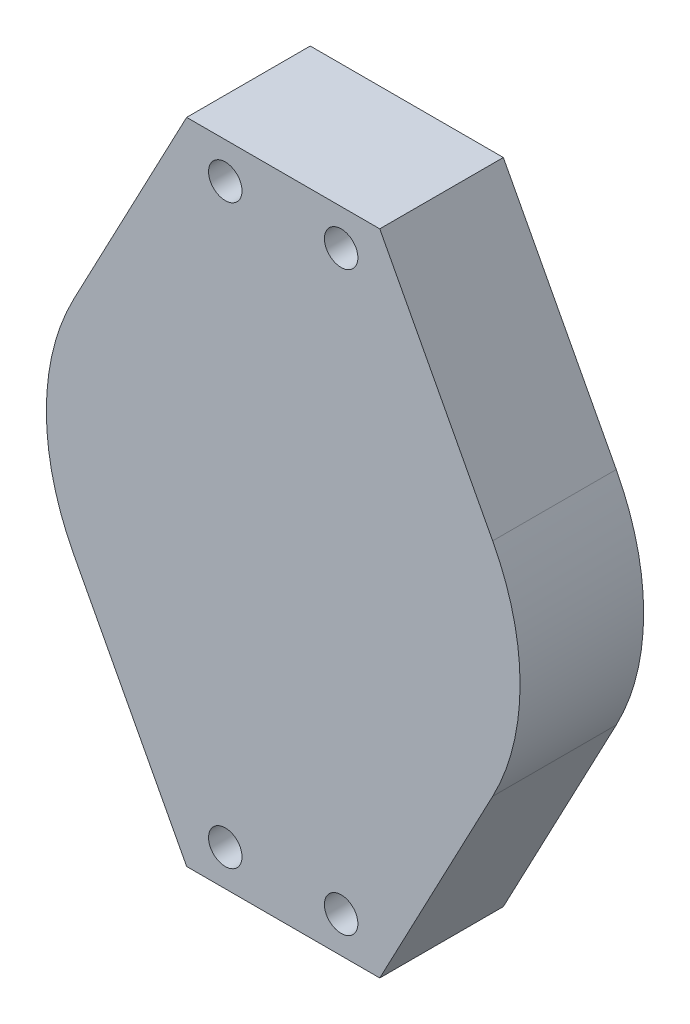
from build123d import *

# Parameters (mm, degrees)
EXTRUSION1_DEPTH                                   = 48
ESQUISSE2_R                                        = 90
ENL_V_MAT_EXTRU_1_DEPTH                            = 32
CHAMBRAGE_POUR_VIS_T_TE_RONDE_BOMB_E_M_D           = 13
CHAMBRAGE_POUR_VIS_T_TE_RONDE_BOMB_E_M_CBORE_D     = 26
CHAMBRAGE_POUR_VIS_T_TE_RONDE_BOMB_E_M_CBORE_DEPTH = 37.5
SYM_TRIE2_COPY_1_D                                 = 13
SYM_TRIE2_COPY_1_CBORE_D                           = 26
SYM_TRIE2_COPY_1_CBORE_DEPTH                       = 37.5


with BuildPart() as part:
    # Esquisse1 → Extrusion1 (new body)
    with BuildSketch(Plane.XY):
        with BuildLine():
            Line((-37.5, 126), (37.5, 126))
            Line((37.5, 126), (81.352427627, 42.962571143))
            ThreePointArc((81.352427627, 42.962571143), (92, 0), (81.352427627, -42.962571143))
            Line((81.352427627, -42.962571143), (37.5, -126))
            Line((37.5, -126), (-37.5, -126))
            Line((-37.5, -126), (-81.352427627, -42.962571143))
            ThreePointArc((-81.352427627, -42.962571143), (-92, 0), (-81.352427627, 42.962571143))
            Line((-81.352427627, 42.962571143), (-37.5, 126))
        make_face()
    extrude(amount=EXTRUSION1_DEPTH)

    # Esquisse2 → Enl_v. mat.-Extru.1 (cut)
    with BuildSketch(Plane(origin=(0, 0, 0), x_dir=(-1, 0, 0), z_dir=(0, 0, -1))):
        Circle(ESQUISSE2_R)
    extrude(amount=-ENL_V_MAT_EXTRU_1_DEPTH, mode=Mode.SUBTRACT)

    # Chambrage pour vis _ t_te ronde bomb_e M (through all)
    with Locations(Plane(origin=(0, 0, 0), x_dir=(-1, 0, 0), z_dir=(0, 0, -1))):
        with Locations((-22.5, 112)):
            chambrage_pour_vis_t_te_ronde_bomb_e_m = CounterBoreHole(CHAMBRAGE_POUR_VIS_T_TE_RONDE_BOMB_E_M_D / 2, CHAMBRAGE_POUR_VIS_T_TE_RONDE_BOMB_E_M_CBORE_D / 2, CHAMBRAGE_POUR_VIS_T_TE_RONDE_BOMB_E_M_CBORE_DEPTH)

    # Sym_trie1: Chambrage pour vis _ t_te ronde bomb_e M across plane
    add(chambrage_pour_vis_t_te_ronde_bomb_e_m.mirror(Plane(origin=(0, 0, 0), x_dir=(0, 0, 1), z_dir=(1, 0, 0))), mode=Mode.SUBTRACT)

    # Sym_trie2: Chambrage pour vis _ t_te ronde bomb_e M across plane
    add(chambrage_pour_vis_t_te_ronde_bomb_e_m.mirror(Plane.ZX), mode=Mode.SUBTRACT)

    # Sym_trie2 copy 1 (through all)
    with Locations(Plane(origin=(0, 0, 0), x_dir=(1, 0, 0), z_dir=(0, 0, -1))):
        with Locations((-22.5, 112)):
            CounterBoreHole(SYM_TRIE2_COPY_1_D / 2, SYM_TRIE2_COPY_1_CBORE_D / 2, SYM_TRIE2_COPY_1_CBORE_DEPTH)


solid = part.part
